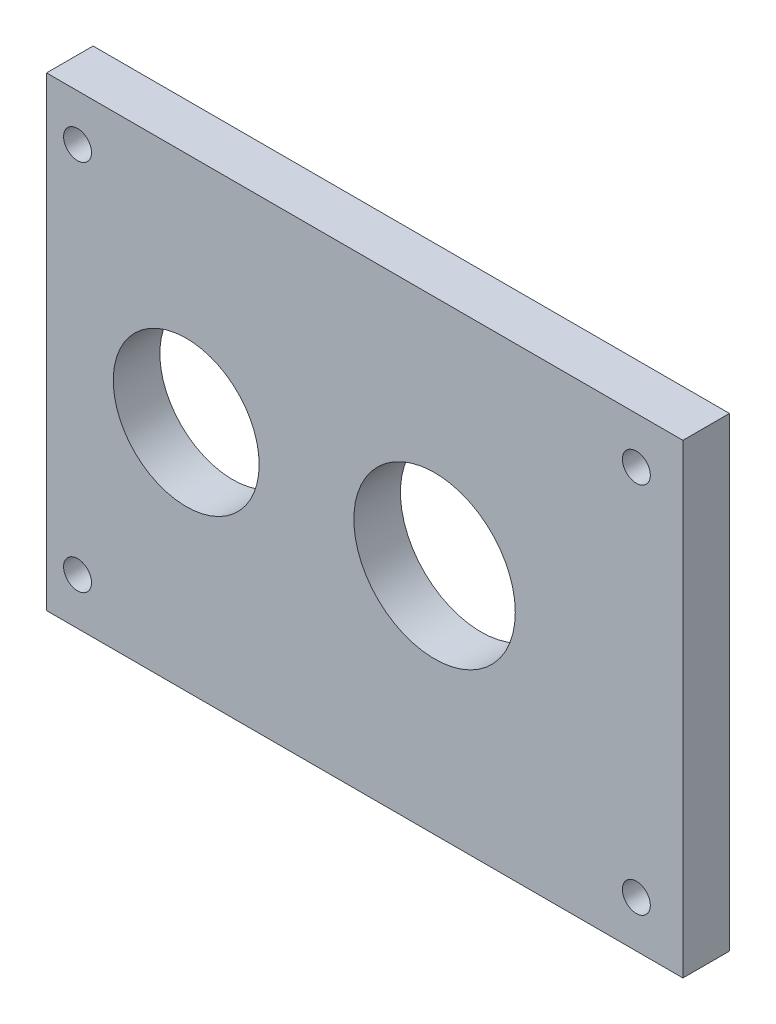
from build123d import *

# Parameters (mm, degrees)
SKIZZE1_W                            = 205
SKIZZE1_H                            = 150
AUFSATZ_LINEAR_AUSTRAGEN1_DEPTH      = 15
SCHNITT_LINEAR_AUSTRAGEN1_DEPTH      = 178.34147851
SCHNITT_LINEAR_AUSTRAGEN1_DEPTH_BACK = 178.34147851
SKIZZE2_R                            = 23.5
SKIZZE2_R_2                          = 26
SKIZZE2_R_3                          = 4.5


with BuildPart() as part:
    # Skizze1 → Aufsatz-Linear austragen1 (new body)
    with BuildSketch(Plane.XY):
        with Locations((57.5, 0)):
            Rectangle(SKIZZE1_W, SKIZZE1_H)
    extrude(amount=AUFSATZ_LINEAR_AUSTRAGEN1_DEPTH)

    # Skizze2 → Schnitt-Linear austragen1 (cut, two sides: drawn at the far end of the back side and taken through both)
    with BuildSketch(Plane.XY.offset(-SCHNITT_LINEAR_AUSTRAGEN1_DEPTH_BACK)):
        Circle(SKIZZE2_R)
        with Locations((80, 0)):
            Circle(SKIZZE2_R_2)
        with Locations((-35, -60)):
            Circle(SKIZZE2_R_3)
        with Locations((145, -60)):
            Circle(SKIZZE2_R_3)
        with Locations((-35, 60)):
            Circle(SKIZZE2_R_3)
        with Locations((145, 60)):
            Circle(SKIZZE2_R_3)
    extrude(amount=SCHNITT_LINEAR_AUSTRAGEN1_DEPTH + SCHNITT_LINEAR_AUSTRAGEN1_DEPTH_BACK, mode=Mode.SUBTRACT)


solid = part.part
